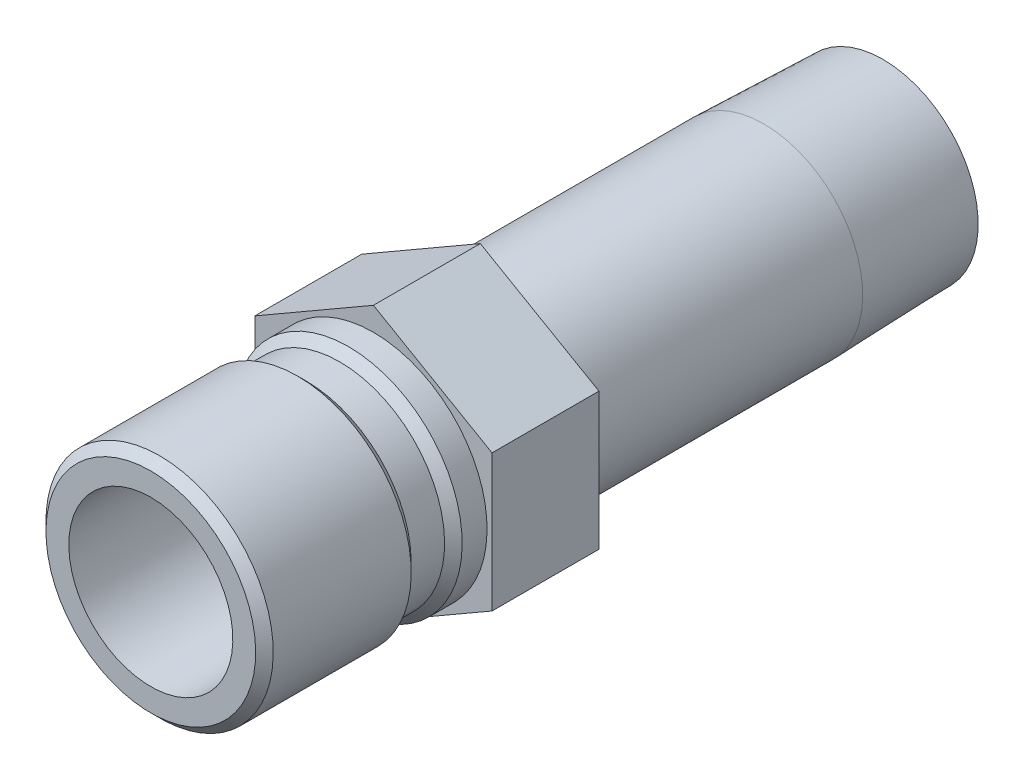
from build123d import *

# Parameters (mm, degrees)
SKETCH2_R           = 7.112
BOSS_EXTRUDE1_DEPTH = 9.271


with BuildPart() as part:
    # Sketch1 → Revolve1 (revolve)
    with BuildSketch(Plane(origin=(0, 0, 0), x_dir=(0, 0, -1), z_dir=(1, 0, 0))):
        Polygon((-19.304, 7.112), (-19.304, 9.0932), (-18.542, 9.8552), (-6.5786, 9.8552), (-5.8166, 9.0932), (-2.921, 9.0932), (-2.159, 9.8552), (0, 9.8552), (0, 8.5725), (33.8582, 8.5725), (44.196, 8.249445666), (44.196, 6.2611), (-1.071568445, 6.2611), (-1.524, 7.112), align=None)
    revolve(axis=Axis((0, 0, 0), (0, 0, 1)))

    # Sketch2 → Boss-Extrude1 (add)
    with BuildSketch(Plane.XY):
        Polygon((-10.287, 5.939202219), (-10.287, -5.939202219), (0, -11.878404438), (10.287, -5.939202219), (10.287, 5.939202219), (0, 11.878404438), align=None)
        with Locations(Location((0, 0, 0), (0, 0, 90))):
            Circle(SKETCH2_R, mode=Mode.SUBTRACT)
    extrude(amount=-BOSS_EXTRUDE1_DEPTH)


solid = part.part
